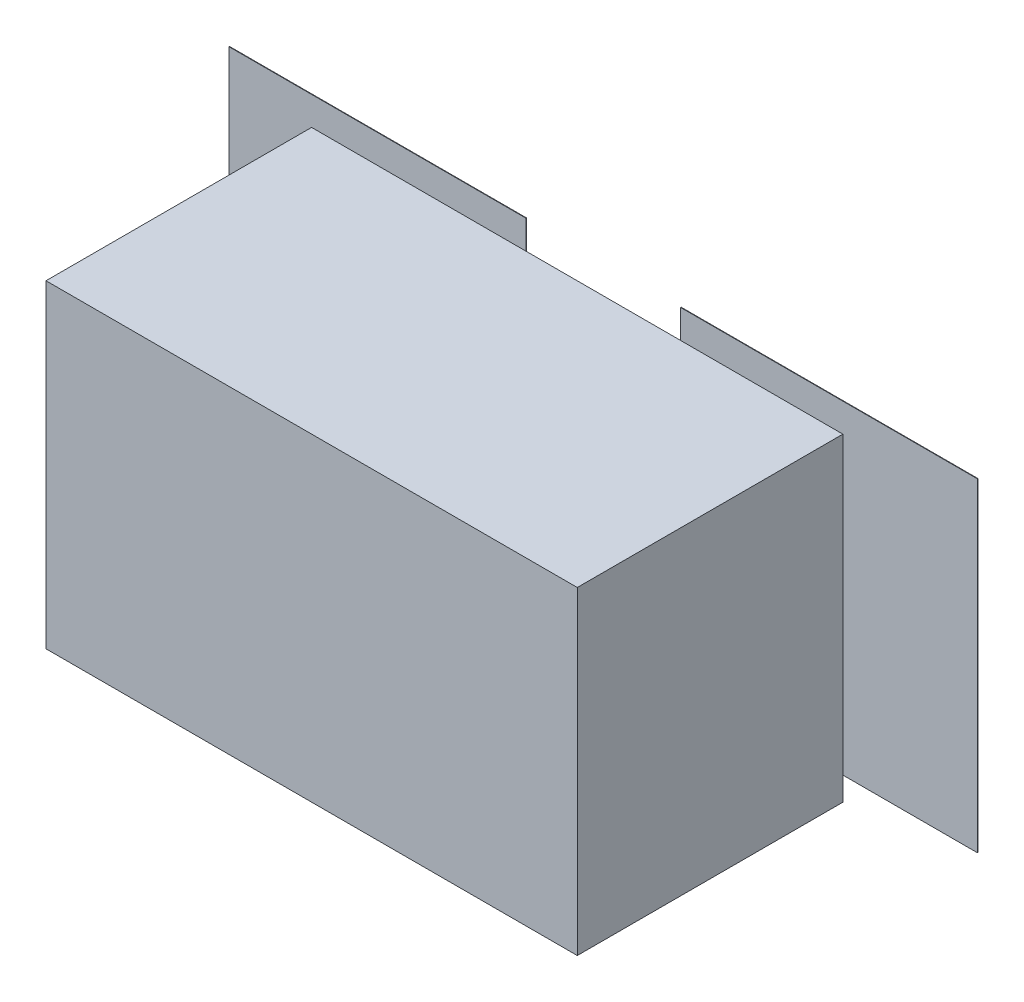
ISO-10303-21;
HEADER;
FILE_DESCRIPTION(('STEP AP214'),'2;1');
FILE_NAME('part.step','',(''),(''),'','','');
FILE_SCHEMA(('AUTOMOTIVE_DESIGN { 1 0 10303 214 1 1 1 1 }'));
ENDSEC;
DATA;
#1=APPLICATION_CONTEXT('core data for automotive mechanical design processes');
#2=APPLICATION_PROTOCOL_DEFINITION('international standard','automotive_design',2000,#1);
#3=PRODUCT_CONTEXT('',#1,'mechanical');
#4=PRODUCT('Part','Part','',(#3));
#5=PRODUCT_RELATED_PRODUCT_CATEGORY('part','',(#4));
#6=PRODUCT_DEFINITION_FORMATION('','',#4);
#7=PRODUCT_DEFINITION_CONTEXT('part definition',#1,'design');
#8=PRODUCT_DEFINITION('design','',#6,#7);
#9=PRODUCT_DEFINITION_SHAPE('','',#8);
#10=(LENGTH_UNIT() NAMED_UNIT(*) SI_UNIT(.MILLI.,.METRE.));
#11=(NAMED_UNIT(*) PLANE_ANGLE_UNIT() SI_UNIT($,.RADIAN.));
#12=(NAMED_UNIT(*) SI_UNIT($,.STERADIAN.) SOLID_ANGLE_UNIT());
#13=UNCERTAINTY_MEASURE_WITH_UNIT(LENGTH_MEASURE(1.E-05),#10,'distance_accuracy_value','');
#14=(GEOMETRIC_REPRESENTATION_CONTEXT(3) GLOBAL_UNCERTAINTY_ASSIGNED_CONTEXT((#13)) GLOBAL_UNIT_ASSIGNED_CONTEXT((#10,
#11,#12)) REPRESENTATION_CONTEXT('',''));
#15=CARTESIAN_POINT('',(0.,0.,0.));
#16=DIRECTION('',(0.,0.,1.));
#17=DIRECTION('',(1.,0.,0.));
#18=AXIS2_PLACEMENT_3D('',#15,#16,#17);
#19=CARTESIAN_POINT('',(0.,0.,0.0762));
#20=DIRECTION('',(0.,0.,1.));
#21=DIRECTION('',(1.,0.,0.));
#22=AXIS2_PLACEMENT_3D('',#19,#20,#21);
#23=PLANE('',#22);
#24=DIRECTION('',(1.,0.,0.));
#25=VECTOR('',#24,1.);
#26=CARTESIAN_POINT('',(-0.704342,-0.3048,0.0762));
#27=LINE('',#26,#25);
#28=CARTESIAN_POINT('',(-0.704342,-0.3048,0.0762));
#29=VERTEX_POINT('',#28);
#30=CARTESIAN_POINT('',(-0.145542,-0.3048,0.0762));
#31=VERTEX_POINT('',#30);
#32=EDGE_CURVE('E166',#29,#31,#27,.T.);
#33=ORIENTED_EDGE('',*,*,#32,.F.);
#34=DIRECTION('',(0.,1.,0.));
#35=VECTOR('',#34,1.);
#36=CARTESIAN_POINT('',(-0.704342,0.3048,0.0762));
#37=LINE('',#36,#35);
#38=CARTESIAN_POINT('',(-0.704342,0.3048,0.0762));
#39=VERTEX_POINT('',#38);
#40=EDGE_CURVE('E163',#39,#29,#37,.F.);
#41=ORIENTED_EDGE('',*,*,#40,.F.);
#42=DIRECTION('',(1.,0.,0.));
#43=VECTOR('',#42,1.);
#44=CARTESIAN_POINT('',(-0.145542,0.3048,0.0762));
#45=LINE('',#44,#43);
#46=CARTESIAN_POINT('',(-0.145542,0.3048,0.0762));
#47=VERTEX_POINT('',#46);
#48=EDGE_CURVE('E219',#47,#39,#45,.F.);
#49=ORIENTED_EDGE('',*,*,#48,.F.);
#50=DIRECTION('',(0.,1.,0.));
#51=VECTOR('',#50,1.);
#52=CARTESIAN_POINT('',(-0.145542,-0.3048,0.0762));
#53=LINE('',#52,#51);
#54=EDGE_CURVE('E189',#31,#47,#53,.T.);
#55=ORIENTED_EDGE('',*,*,#54,.F.);
#56=EDGE_LOOP('',(#33,#41,#49,#55));
#57=FACE_BOUND('',#56,.T.);
#58=ADVANCED_FACE('F17',(#57),#23,.F.);
#59=CARTESIAN_POINT('',(0.,0.,0.0762));
#60=DIRECTION('',(0.,0.,1.));
#61=DIRECTION('',(1.,0.,0.));
#62=AXIS2_PLACEMENT_3D('',#59,#60,#61);
#63=PLANE('',#62);
#64=DIRECTION('',(1.,0.,0.));
#65=VECTOR('',#64,1.);
#66=CARTESIAN_POINT('',(0.145542,-0.3048,0.0762));
#67=LINE('',#66,#65);
#68=CARTESIAN_POINT('',(0.145542,-0.3048,0.0762));
#69=VERTEX_POINT('',#68);
#70=CARTESIAN_POINT('',(0.704342,-0.3048,0.0762));
#71=VERTEX_POINT('',#70);
#72=EDGE_CURVE('E211',#69,#71,#67,.T.);
#73=ORIENTED_EDGE('',*,*,#72,.F.);
#74=DIRECTION('',(0.,1.,0.));
#75=VECTOR('',#74,1.);
#76=CARTESIAN_POINT('',(0.145542,0.3048,0.0762));
#77=LINE('',#76,#75);
#78=CARTESIAN_POINT('',(0.145542,0.3048,0.0762));
#79=VERTEX_POINT('',#78);
#80=EDGE_CURVE('E215',#79,#69,#77,.F.);
#81=ORIENTED_EDGE('',*,*,#80,.F.);
#82=DIRECTION('',(1.,0.,0.));
#83=VECTOR('',#82,1.);
#84=CARTESIAN_POINT('',(0.704342,0.3048,0.0762));
#85=LINE('',#84,#83);
#86=CARTESIAN_POINT('',(0.704342,0.3048,0.0762));
#87=VERTEX_POINT('',#86);
#88=EDGE_CURVE('E181',#87,#79,#85,.F.);
#89=ORIENTED_EDGE('',*,*,#88,.F.);
#90=DIRECTION('',(0.,1.,0.));
#91=VECTOR('',#90,1.);
#92=CARTESIAN_POINT('',(0.704342,-0.3048,0.0762));
#93=LINE('',#92,#91);
#94=EDGE_CURVE('E207',#71,#87,#93,.T.);
#95=ORIENTED_EDGE('',*,*,#94,.F.);
#96=EDGE_LOOP('',(#73,#81,#89,#95));
#97=FACE_BOUND('',#96,.T.);
#98=ADVANCED_FACE('F588',(#97),#63,.F.);
#99=CARTESIAN_POINT('',(-0.704342,0.3048,0.0762));
#100=DIRECTION('',(-1.,0.,0.));
#101=DIRECTION('',(0.,0.,1.));
#102=AXIS2_PLACEMENT_3D('',#99,#100,#101);
#103=PLANE('',#102);
#104=DIRECTION('',(0.,0.,1.));
#105=VECTOR('',#104,1.);
#106=CARTESIAN_POINT('',(-0.704342,0.3048,0.0762));
#107=LINE('',#106,#105);
#108=CARTESIAN_POINT('',(-0.704342,0.3048,0.077199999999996));
#109=VERTEX_POINT('',#108);
#110=EDGE_CURVE('E190',#39,#109,#107,.T.);
#111=ORIENTED_EDGE('',*,*,#110,.F.);
#112=ORIENTED_EDGE('',*,*,#40,.T.);
#113=DIRECTION('',(0.,0.,-1.));
#114=VECTOR('',#113,1.);
#115=CARTESIAN_POINT('',(-0.704342,-0.3048,0.0762));
#116=LINE('',#115,#114);
#117=CARTESIAN_POINT('',(-0.704342,-0.3048,0.077199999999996));
#118=VERTEX_POINT('',#117);
#119=EDGE_CURVE('E20',#118,#29,#116,.T.);
#120=ORIENTED_EDGE('',*,*,#119,.F.);
#121=DIRECTION('',(0.,1.,0.));
#122=VECTOR('',#121,1.);
#123=CARTESIAN_POINT('',(-0.704342,0.,0.077199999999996));
#124=LINE('',#123,#122);
#125=EDGE_CURVE('E161',#109,#118,#124,.F.);
#126=ORIENTED_EDGE('',*,*,#125,.F.);
#127=EDGE_LOOP('',(#111,#112,#120,#126));
#128=FACE_BOUND('',#127,.T.);
#129=ADVANCED_FACE('F159',(#128),#103,.T.);
#130=CARTESIAN_POINT('',(-0.704342,-0.3048,0.0762));
#131=DIRECTION('',(0.,-1.,0.));
#132=DIRECTION('',(0.,0.,-1.));
#133=AXIS2_PLACEMENT_3D('',#130,#131,#132);
#134=PLANE('',#133);
#135=ORIENTED_EDGE('',*,*,#119,.T.);
#136=ORIENTED_EDGE('',*,*,#32,.T.);
#137=DIRECTION('',(0.,0.,-1.));
#138=VECTOR('',#137,1.);
#139=CARTESIAN_POINT('',(-0.145542,-0.3048,0.0762));
#140=LINE('',#139,#138);
#141=CARTESIAN_POINT('',(-0.145542,-0.3048,0.077199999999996));
#142=VERTEX_POINT('',#141);
#143=EDGE_CURVE('E171',#142,#31,#140,.T.);
#144=ORIENTED_EDGE('',*,*,#143,.F.);
#145=DIRECTION('',(1.,0.,0.));
#146=VECTOR('',#145,1.);
#147=CARTESIAN_POINT('',(0.,-0.3048,0.077199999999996));
#148=LINE('',#147,#146);
#149=EDGE_CURVE('E168',#118,#142,#148,.T.);
#150=ORIENTED_EDGE('',*,*,#149,.F.);
#151=EDGE_LOOP('',(#135,#136,#144,#150));
#152=FACE_BOUND('',#151,.T.);
#153=ADVANCED_FACE('F169',(#152),#134,.T.);
#154=CARTESIAN_POINT('',(-0.145542,-0.3048,0.0762));
#155=DIRECTION('',(1.,0.,0.));
#156=DIRECTION('',(0.,0.,-1.));
#157=AXIS2_PLACEMENT_3D('',#154,#155,#156);
#158=PLANE('',#157);
#159=ORIENTED_EDGE('',*,*,#143,.T.);
#160=ORIENTED_EDGE('',*,*,#54,.T.);
#161=DIRECTION('',(0.,0.,1.));
#162=VECTOR('',#161,1.);
#163=CARTESIAN_POINT('',(-0.145542,0.3048,0.0762));
#164=LINE('',#163,#162);
#165=CARTESIAN_POINT('',(-0.145542,0.3048,0.077199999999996));
#166=VERTEX_POINT('',#165);
#167=EDGE_CURVE('E216',#166,#47,#164,.F.);
#168=ORIENTED_EDGE('',*,*,#167,.F.);
#169=DIRECTION('',(0.,1.,0.));
#170=VECTOR('',#169,1.);
#171=CARTESIAN_POINT('',(-0.145542,0.,0.077199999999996));
#172=LINE('',#171,#170);
#173=EDGE_CURVE('E175',#142,#166,#172,.T.);
#174=ORIENTED_EDGE('',*,*,#173,.F.);
#175=EDGE_LOOP('',(#159,#160,#168,#174));
#176=FACE_BOUND('',#175,.T.);
#177=ADVANCED_FACE('F221',(#176),#158,.T.);
#178=CARTESIAN_POINT('',(-0.145542,0.3048,0.0762));
#179=DIRECTION('',(0.,1.,0.));
#180=DIRECTION('',(0.,0.,1.));
#181=AXIS2_PLACEMENT_3D('',#178,#179,#180);
#182=PLANE('',#181);
#183=ORIENTED_EDGE('',*,*,#167,.T.);
#184=ORIENTED_EDGE('',*,*,#48,.T.);
#185=ORIENTED_EDGE('',*,*,#110,.T.);
#186=DIRECTION('',(1.,0.,0.));
#187=VECTOR('',#186,1.);
#188=CARTESIAN_POINT('',(0.,0.3048,0.077199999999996));
#189=LINE('',#188,#187);
#190=EDGE_CURVE('E180',#166,#109,#189,.F.);
#191=ORIENTED_EDGE('',*,*,#190,.F.);
#192=EDGE_LOOP('',(#183,#184,#185,#191));
#193=FACE_BOUND('',#192,.T.);
#194=ADVANCED_FACE('F557',(#193),#182,.T.);
#195=CARTESIAN_POINT('',(0.145542,0.3048,0.0762));
#196=DIRECTION('',(-1.,0.,0.));
#197=DIRECTION('',(0.,0.,1.));
#198=AXIS2_PLACEMENT_3D('',#195,#196,#197);
#199=PLANE('',#198);
#200=DIRECTION('',(0.,0.,1.));
#201=VECTOR('',#200,1.);
#202=CARTESIAN_POINT('',(0.145542,0.3048,0.0762));
#203=LINE('',#202,#201);
#204=CARTESIAN_POINT('',(0.145542,0.3048,0.077199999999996));
#205=VERTEX_POINT('',#204);
#206=EDGE_CURVE('E204',#79,#205,#203,.T.);
#207=ORIENTED_EDGE('',*,*,#206,.F.);
#208=ORIENTED_EDGE('',*,*,#80,.T.);
#209=DIRECTION('',(0.,0.,-1.));
#210=VECTOR('',#209,1.);
#211=CARTESIAN_POINT('',(0.145542,-0.3048,0.0762));
#212=LINE('',#211,#210);
#213=CARTESIAN_POINT('',(0.145542,-0.3048,0.077199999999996));
#214=VERTEX_POINT('',#213);
#215=EDGE_CURVE('E212',#214,#69,#212,.T.);
#216=ORIENTED_EDGE('',*,*,#215,.F.);
#217=DIRECTION('',(0.,1.,0.));
#218=VECTOR('',#217,1.);
#219=CARTESIAN_POINT('',(0.145542,0.,0.077199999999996));
#220=LINE('',#219,#218);
#221=EDGE_CURVE('E224',#205,#214,#220,.F.);
#222=ORIENTED_EDGE('',*,*,#221,.F.);
#223=EDGE_LOOP('',(#207,#208,#216,#222));
#224=FACE_BOUND('',#223,.T.);
#225=ADVANCED_FACE('F548',(#224),#199,.T.);
#226=CARTESIAN_POINT('',(0.145542,-0.3048,0.0762));
#227=DIRECTION('',(0.,-1.,0.));
#228=DIRECTION('',(0.,0.,-1.));
#229=AXIS2_PLACEMENT_3D('',#226,#227,#228);
#230=PLANE('',#229);
#231=ORIENTED_EDGE('',*,*,#215,.T.);
#232=ORIENTED_EDGE('',*,*,#72,.T.);
#233=DIRECTION('',(0.,0.,-1.));
#234=VECTOR('',#233,1.);
#235=CARTESIAN_POINT('',(0.704342,-0.3048,0.0762));
#236=LINE('',#235,#234);
#237=CARTESIAN_POINT('',(0.704342,-0.3048,0.077199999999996));
#238=VERTEX_POINT('',#237);
#239=EDGE_CURVE('E208',#238,#71,#236,.T.);
#240=ORIENTED_EDGE('',*,*,#239,.F.);
#241=DIRECTION('',(1.,0.,0.));
#242=VECTOR('',#241,1.);
#243=CARTESIAN_POINT('',(0.,-0.3048,0.077199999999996));
#244=LINE('',#243,#242);
#245=EDGE_CURVE('E230',#214,#238,#244,.T.);
#246=ORIENTED_EDGE('',*,*,#245,.F.);
#247=EDGE_LOOP('',(#231,#232,#240,#246));
#248=FACE_BOUND('',#247,.T.);
#249=ADVANCED_FACE('F539',(#248),#230,.T.);
#250=CARTESIAN_POINT('',(0.704342,-0.3048,0.0762));
#251=DIRECTION('',(1.,0.,0.));
#252=DIRECTION('',(0.,0.,-1.));
#253=AXIS2_PLACEMENT_3D('',#250,#251,#252);
#254=PLANE('',#253);
#255=ORIENTED_EDGE('',*,*,#239,.T.);
#256=ORIENTED_EDGE('',*,*,#94,.T.);
#257=DIRECTION('',(0.,0.,1.));
#258=VECTOR('',#257,1.);
#259=CARTESIAN_POINT('',(0.704342,0.3048,0.0762));
#260=LINE('',#259,#258);
#261=CARTESIAN_POINT('',(0.704342,0.3048,0.077199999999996));
#262=VERTEX_POINT('',#261);
#263=EDGE_CURVE('E184',#262,#87,#260,.F.);
#264=ORIENTED_EDGE('',*,*,#263,.F.);
#265=DIRECTION('',(0.,1.,0.));
#266=VECTOR('',#265,1.);
#267=CARTESIAN_POINT('',(0.704342,0.,0.077199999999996));
#268=LINE('',#267,#266);
#269=EDGE_CURVE('E233',#238,#262,#268,.T.);
#270=ORIENTED_EDGE('',*,*,#269,.F.);
#271=EDGE_LOOP('',(#255,#256,#264,#270));
#272=FACE_BOUND('',#271,.T.);
#273=ADVANCED_FACE('F530',(#272),#254,.T.);
#274=CARTESIAN_POINT('',(0.704342,0.3048,0.0762));
#275=DIRECTION('',(0.,1.,0.));
#276=DIRECTION('',(0.,0.,1.));
#277=AXIS2_PLACEMENT_3D('',#274,#275,#276);
#278=PLANE('',#277);
#279=ORIENTED_EDGE('',*,*,#263,.T.);
#280=ORIENTED_EDGE('',*,*,#88,.T.);
#281=ORIENTED_EDGE('',*,*,#206,.T.);
#282=DIRECTION('',(1.,0.,0.));
#283=VECTOR('',#282,1.);
#284=CARTESIAN_POINT('',(0.,0.3048,0.077199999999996));
#285=LINE('',#284,#283);
#286=EDGE_CURVE('E237',#262,#205,#285,.F.);
#287=ORIENTED_EDGE('',*,*,#286,.F.);
#288=EDGE_LOOP('',(#279,#280,#281,#287));
#289=FACE_BOUND('',#288,.T.);
#290=ADVANCED_FACE('F521',(#289),#278,.T.);
#291=CARTESIAN_POINT('',(0.,0.,0.077199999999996));
#292=DIRECTION('',(0.,0.,1.));
#293=DIRECTION('',(1.,0.,0.));
#294=AXIS2_PLACEMENT_3D('',#291,#292,#293);
#295=PLANE('',#294);
#296=DIRECTION('',(1.,0.,0.));
#297=VECTOR('',#296,1.);
#298=CARTESIAN_POINT('',(-0.449999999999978,-0.249999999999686,0.077199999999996));
#299=LINE('',#298,#297);
#300=CARTESIAN_POINT('',(-0.449999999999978,-0.249999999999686,0.077199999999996));
#301=VERTEX_POINT('',#300);
#302=CARTESIAN_POINT('',(-0.199999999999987,-0.249999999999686,0.077199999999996));
#303=VERTEX_POINT('',#302);
#304=EDGE_CURVE('E266',#301,#303,#299,.T.);
#305=ORIENTED_EDGE('',*,*,#304,.F.);
#306=DIRECTION('',(0.,1.,0.));
#307=VECTOR('',#306,1.);
#308=CARTESIAN_POINT('',(-0.449999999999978,0.250000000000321,0.077199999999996));
#309=LINE('',#308,#307);
#310=CARTESIAN_POINT('',(-0.449999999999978,0.250000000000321,0.077199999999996));
#311=VERTEX_POINT('',#310);
#312=EDGE_CURVE('E240',#311,#301,#309,.F.);
#313=ORIENTED_EDGE('',*,*,#312,.F.);
#314=DIRECTION('',(1.,0.,0.));
#315=VECTOR('',#314,1.);
#316=CARTESIAN_POINT('',(-0.199999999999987,0.250000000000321,0.077199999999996));
#317=LINE('',#316,#315);
#318=CARTESIAN_POINT('',(-0.199999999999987,0.250000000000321,0.077199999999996));
#319=VERTEX_POINT('',#318);
#320=EDGE_CURVE('E271',#319,#311,#317,.F.);
#321=ORIENTED_EDGE('',*,*,#320,.F.);
#322=DIRECTION('',(0.,1.,0.));
#323=VECTOR('',#322,1.);
#324=CARTESIAN_POINT('',(-0.199999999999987,-0.249999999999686,0.077199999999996));
#325=LINE('',#324,#323);
#326=EDGE_CURVE('E277',#303,#319,#325,.T.);
#327=ORIENTED_EDGE('',*,*,#326,.F.);
#328=EDGE_LOOP('',(#305,#313,#321,#327));
#329=FACE_BOUND('',#328,.T.);
#330=ORIENTED_EDGE('',*,*,#173,.T.);
#331=ORIENTED_EDGE('',*,*,#190,.T.);
#332=ORIENTED_EDGE('',*,*,#125,.T.);
#333=ORIENTED_EDGE('',*,*,#149,.T.);
#334=EDGE_LOOP('',(#330,#331,#332,#333));
#335=FACE_BOUND('',#334,.T.);
#336=ADVANCED_FACE('F178',(#329,#335),#295,.T.);
#337=CARTESIAN_POINT('',(0.,0.,0.077199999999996));
#338=DIRECTION('',(0.,0.,1.));
#339=DIRECTION('',(1.,0.,0.));
#340=AXIS2_PLACEMENT_3D('',#337,#338,#339);
#341=PLANE('',#340);
#342=DIRECTION('',(0.,1.,0.));
#343=VECTOR('',#342,1.);
#344=CARTESIAN_POINT('',(0.199999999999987,0.250000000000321,0.077199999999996));
#345=LINE('',#344,#343);
#346=CARTESIAN_POINT('',(0.199999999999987,0.250000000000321,0.077199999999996));
#347=VERTEX_POINT('',#346);
#348=CARTESIAN_POINT('',(0.199999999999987,-0.249999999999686,0.077199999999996));
#349=VERTEX_POINT('',#348);
#350=EDGE_CURVE('E257',#347,#349,#345,.F.);
#351=ORIENTED_EDGE('',*,*,#350,.F.);
#352=DIRECTION('',(1.,0.,0.));
#353=VECTOR('',#352,1.);
#354=CARTESIAN_POINT('',(0.449999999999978,0.250000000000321,0.077199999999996));
#355=LINE('',#354,#353);
#356=CARTESIAN_POINT('',(0.449999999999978,0.250000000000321,0.077199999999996));
#357=VERTEX_POINT('',#356);
#358=EDGE_CURVE('E264',#357,#347,#355,.F.);
#359=ORIENTED_EDGE('',*,*,#358,.F.);
#360=DIRECTION('',(0.,1.,0.));
#361=VECTOR('',#360,1.);
#362=CARTESIAN_POINT('',(0.449999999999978,-0.149999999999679,0.077199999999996));
#363=LINE('',#362,#361);
#364=CARTESIAN_POINT('',(0.449999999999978,-0.149999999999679,0.077199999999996));
#365=VERTEX_POINT('',#364);
#366=EDGE_CURVE('E201',#365,#357,#363,.T.);
#367=ORIENTED_EDGE('',*,*,#366,.F.);
#368=CARTESIAN_POINT('',(0.449999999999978,-0.249999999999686,0.077199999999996));
#369=DIRECTION('',(0.,0.,1.));
#370=DIRECTION('',(1.,0.,0.));
#371=AXIS2_PLACEMENT_3D('',#368,#369,#370);
#372=CIRCLE('',#371,0.100000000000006);
#373=CARTESIAN_POINT('',(0.350000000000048,-0.249999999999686,0.077199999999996));
#374=VERTEX_POINT('',#373);
#375=EDGE_CURVE('E198',#365,#374,#372,.T.);
#376=ORIENTED_EDGE('',*,*,#375,.T.);
#377=DIRECTION('',(1.,0.,0.));
#378=VECTOR('',#377,1.);
#379=CARTESIAN_POINT('',(0.199999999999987,-0.249999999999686,0.077199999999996));
#380=LINE('',#379,#378);
#381=EDGE_CURVE('E250',#349,#374,#380,.T.);
#382=ORIENTED_EDGE('',*,*,#381,.F.);
#383=EDGE_LOOP('',(#351,#359,#367,#376,#382));
#384=FACE_BOUND('',#383,.T.);
#385=ORIENTED_EDGE('',*,*,#269,.T.);
#386=ORIENTED_EDGE('',*,*,#286,.T.);
#387=ORIENTED_EDGE('',*,*,#221,.T.);
#388=ORIENTED_EDGE('',*,*,#245,.T.);
#389=EDGE_LOOP('',(#385,#386,#387,#388));
#390=FACE_BOUND('',#389,.T.);
#391=ADVANCED_FACE('F504',(#384,#390),#341,.T.);
#392=CARTESIAN_POINT('',(-0.449999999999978,0.250000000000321,0.0762));
#393=DIRECTION('',(-1.,0.,0.));
#394=DIRECTION('',(0.,0.,1.));
#395=AXIS2_PLACEMENT_3D('',#392,#393,#394);
#396=PLANE('',#395);
#397=DIRECTION('',(0.,0.,1.));
#398=VECTOR('',#397,1.);
#399=CARTESIAN_POINT('',(-0.449999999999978,0.250000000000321,0.0762));
#400=LINE('',#399,#398);
#401=CARTESIAN_POINT('',(-0.449999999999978,0.250000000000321,0.126200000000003));
#402=VERTEX_POINT('',#401);
#403=EDGE_CURVE('E268',#311,#402,#400,.T.);
#404=ORIENTED_EDGE('',*,*,#403,.F.);
#405=ORIENTED_EDGE('',*,*,#312,.T.);
#406=DIRECTION('',(0.,0.,-1.));
#407=VECTOR('',#406,1.);
#408=CARTESIAN_POINT('',(-0.449999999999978,-0.249999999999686,0.0762));
#409=LINE('',#408,#407);
#410=CARTESIAN_POINT('',(-0.449999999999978,-0.249999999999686,0.126200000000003));
#411=VERTEX_POINT('',#410);
#412=EDGE_CURVE('E283',#411,#301,#409,.T.);
#413=ORIENTED_EDGE('',*,*,#412,.F.);
#414=DIRECTION('',(0.,1.,0.));
#415=VECTOR('',#414,1.);
#416=CARTESIAN_POINT('',(-0.449999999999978,0.,0.126200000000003));
#417=LINE('',#416,#415);
#418=EDGE_CURVE('E260',#411,#402,#417,.T.);
#419=ORIENTED_EDGE('',*,*,#418,.T.);
#420=EDGE_LOOP('',(#404,#405,#413,#419));
#421=FACE_BOUND('',#420,.T.);
#422=ADVANCED_FACE('F495',(#421),#396,.T.);
#423=CARTESIAN_POINT('',(-0.199999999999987,0.250000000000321,0.0762));
#424=DIRECTION('',(0.,1.,0.));
#425=DIRECTION('',(0.,0.,1.));
#426=AXIS2_PLACEMENT_3D('',#423,#424,#425);
#427=PLANE('',#426);
#428=DIRECTION('',(0.,0.,-1.));
#429=VECTOR('',#428,1.);
#430=CARTESIAN_POINT('',(-0.199999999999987,0.250000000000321,0.0762));
#431=LINE('',#430,#429);
#432=CARTESIAN_POINT('',(-0.199999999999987,0.250000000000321,0.126200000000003));
#433=VERTEX_POINT('',#432);
#434=EDGE_CURVE('E274',#319,#433,#431,.F.);
#435=ORIENTED_EDGE('',*,*,#434,.F.);
#436=ORIENTED_EDGE('',*,*,#320,.T.);
#437=ORIENTED_EDGE('',*,*,#403,.T.);
#438=DIRECTION('',(1.,0.,0.));
#439=VECTOR('',#438,1.);
#440=CARTESIAN_POINT('',(0.,0.250000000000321,0.126200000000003));
#441=LINE('',#440,#439);
#442=EDGE_CURVE('E316',#402,#433,#441,.T.);
#443=ORIENTED_EDGE('',*,*,#442,.T.);
#444=EDGE_LOOP('',(#435,#436,#437,#443));
#445=FACE_BOUND('',#444,.T.);
#446=ADVANCED_FACE('F486',(#445),#427,.T.);
#447=CARTESIAN_POINT('',(-0.199999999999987,-0.249999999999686,0.0762));
#448=DIRECTION('',(1.,0.,0.));
#449=DIRECTION('',(0.,0.,-1.));
#450=AXIS2_PLACEMENT_3D('',#447,#448,#449);
#451=PLANE('',#450);
#452=DIRECTION('',(0.,0.,-1.));
#453=VECTOR('',#452,1.);
#454=CARTESIAN_POINT('',(-0.199999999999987,-0.249999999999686,0.0762));
#455=LINE('',#454,#453);
#456=CARTESIAN_POINT('',(-0.199999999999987,-0.249999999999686,0.126200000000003));
#457=VERTEX_POINT('',#456);
#458=EDGE_CURVE('E280',#303,#457,#455,.F.);
#459=ORIENTED_EDGE('',*,*,#458,.F.);
#460=ORIENTED_EDGE('',*,*,#326,.T.);
#461=ORIENTED_EDGE('',*,*,#434,.T.);
#462=DIRECTION('',(0.,1.,0.));
#463=VECTOR('',#462,1.);
#464=CARTESIAN_POINT('',(-0.199999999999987,0.,0.126200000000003));
#465=LINE('',#464,#463);
#466=EDGE_CURVE('E318',#433,#457,#465,.F.);
#467=ORIENTED_EDGE('',*,*,#466,.T.);
#468=EDGE_LOOP('',(#459,#460,#461,#467));
#469=FACE_BOUND('',#468,.T.);
#470=ADVANCED_FACE('F477',(#469),#451,.T.);
#471=CARTESIAN_POINT('',(-0.449999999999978,-0.249999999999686,0.0762));
#472=DIRECTION('',(0.,-1.,0.));
#473=DIRECTION('',(0.,0.,-1.));
#474=AXIS2_PLACEMENT_3D('',#471,#472,#473);
#475=PLANE('',#474);
#476=ORIENTED_EDGE('',*,*,#412,.T.);
#477=ORIENTED_EDGE('',*,*,#304,.T.);
#478=ORIENTED_EDGE('',*,*,#458,.T.);
#479=DIRECTION('',(1.,0.,0.));
#480=VECTOR('',#479,1.);
#481=CARTESIAN_POINT('',(0.,-0.249999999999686,0.126200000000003));
#482=LINE('',#481,#480);
#483=EDGE_CURVE('E296',#457,#411,#482,.F.);
#484=ORIENTED_EDGE('',*,*,#483,.T.);
#485=EDGE_LOOP('',(#476,#477,#478,#484));
#486=FACE_BOUND('',#485,.T.);
#487=ADVANCED_FACE('F468',(#486),#475,.T.);
#488=CARTESIAN_POINT('',(0.449999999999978,0.250000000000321,0.0762));
#489=DIRECTION('',(0.,1.,0.));
#490=DIRECTION('',(0.,0.,1.));
#491=AXIS2_PLACEMENT_3D('',#488,#489,#490);
#492=PLANE('',#491);
#493=DIRECTION('',(0.,0.,-1.));
#494=VECTOR('',#493,1.);
#495=CARTESIAN_POINT('',(0.449999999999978,0.250000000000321,0.0762));
#496=LINE('',#495,#494);
#497=CARTESIAN_POINT('',(0.449999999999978,0.250000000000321,0.126200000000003));
#498=VERTEX_POINT('',#497);
#499=EDGE_CURVE('E247',#357,#498,#496,.F.);
#500=ORIENTED_EDGE('',*,*,#499,.F.);
#501=ORIENTED_EDGE('',*,*,#358,.T.);
#502=DIRECTION('',(0.,0.,1.));
#503=VECTOR('',#502,1.);
#504=CARTESIAN_POINT('',(0.199999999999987,0.250000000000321,0.0762));
#505=LINE('',#504,#503);
#506=CARTESIAN_POINT('',(0.199999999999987,0.250000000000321,0.126200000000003));
#507=VERTEX_POINT('',#506);
#508=EDGE_CURVE('E261',#507,#347,#505,.F.);
#509=ORIENTED_EDGE('',*,*,#508,.F.);
#510=DIRECTION('',(1.,0.,0.));
#511=VECTOR('',#510,1.);
#512=CARTESIAN_POINT('',(0.,0.250000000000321,0.126200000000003));
#513=LINE('',#512,#511);
#514=EDGE_CURVE('E294',#507,#498,#513,.T.);
#515=ORIENTED_EDGE('',*,*,#514,.T.);
#516=EDGE_LOOP('',(#500,#501,#509,#515));
#517=FACE_BOUND('',#516,.T.);
#518=ADVANCED_FACE('F459',(#517),#492,.T.);
#519=CARTESIAN_POINT('',(0.449999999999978,-0.149999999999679,0.0762));
#520=DIRECTION('',(1.,0.,0.));
#521=DIRECTION('',(0.,0.,-1.));
#522=AXIS2_PLACEMENT_3D('',#519,#520,#521);
#523=PLANE('',#522);
#524=DIRECTION('',(0.,0.,1.));
#525=VECTOR('',#524,1.);
#526=CARTESIAN_POINT('',(0.449999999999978,-0.149999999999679,0.0762));
#527=LINE('',#526,#525);
#528=CARTESIAN_POINT('',(0.449999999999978,-0.149999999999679,0.126200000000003));
#529=VERTEX_POINT('',#528);
#530=EDGE_CURVE('E200',#529,#365,#527,.F.);
#531=ORIENTED_EDGE('',*,*,#530,.T.);
#532=ORIENTED_EDGE('',*,*,#366,.T.);
#533=ORIENTED_EDGE('',*,*,#499,.T.);
#534=DIRECTION('',(0.,1.,0.));
#535=VECTOR('',#534,1.);
#536=CARTESIAN_POINT('',(0.449999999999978,0.,0.126200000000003));
#537=LINE('',#536,#535);
#538=EDGE_CURVE('E197',#498,#529,#537,.F.);
#539=ORIENTED_EDGE('',*,*,#538,.T.);
#540=EDGE_LOOP('',(#531,#532,#533,#539));
#541=FACE_BOUND('',#540,.T.);
#542=ADVANCED_FACE('F450',(#541),#523,.T.);
#543=CARTESIAN_POINT('',(0.449999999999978,-0.249999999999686,0.0762));
#544=DIRECTION('',(0.,0.,1.));
#545=DIRECTION('',(1.,0.,0.));
#546=AXIS2_PLACEMENT_3D('',#543,#544,#545);
#547=CYLINDRICAL_SURFACE('',#546,0.100000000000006);
#548=CARTESIAN_POINT('',(0.449999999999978,-0.249999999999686,0.126200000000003));
#549=DIRECTION('',(0.,0.,1.));
#550=DIRECTION('',(1.,0.,0.));
#551=AXIS2_PLACEMENT_3D('',#548,#549,#550);
#552=CIRCLE('',#551,0.100000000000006);
#553=CARTESIAN_POINT('',(0.350000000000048,-0.249999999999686,0.126200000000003));
#554=VERTEX_POINT('',#553);
#555=EDGE_CURVE('E194',#529,#554,#552,.T.);
#556=ORIENTED_EDGE('',*,*,#555,.T.);
#557=DIRECTION('',(0.,0.,-1.));
#558=VECTOR('',#557,1.);
#559=CARTESIAN_POINT('',(0.350000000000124,-0.249999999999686,0.0762));
#560=LINE('',#559,#558);
#561=EDGE_CURVE('E254',#374,#554,#560,.F.);
#562=ORIENTED_EDGE('',*,*,#561,.F.);
#563=ORIENTED_EDGE('',*,*,#375,.F.);
#564=ORIENTED_EDGE('',*,*,#530,.F.);
#565=EDGE_LOOP('',(#556,#562,#563,#564));
#566=FACE_BOUND('',#565,.T.);
#567=ADVANCED_FACE('F441',(#566),#547,.F.);
#568=CARTESIAN_POINT('',(0.199999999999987,-0.249999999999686,0.0762));
#569=DIRECTION('',(0.,-1.,0.));
#570=DIRECTION('',(0.,0.,-1.));
#571=AXIS2_PLACEMENT_3D('',#568,#569,#570);
#572=PLANE('',#571);
#573=DIRECTION('',(0.,0.,1.));
#574=VECTOR('',#573,1.);
#575=CARTESIAN_POINT('',(0.199999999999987,-0.249999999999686,0.0762));
#576=LINE('',#575,#574);
#577=CARTESIAN_POINT('',(0.199999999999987,-0.249999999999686,0.126200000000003));
#578=VERTEX_POINT('',#577);
#579=EDGE_CURVE('E253',#349,#578,#576,.T.);
#580=ORIENTED_EDGE('',*,*,#579,.F.);
#581=ORIENTED_EDGE('',*,*,#381,.T.);
#582=ORIENTED_EDGE('',*,*,#561,.T.);
#583=DIRECTION('',(1.,0.,0.));
#584=VECTOR('',#583,1.);
#585=CARTESIAN_POINT('',(0.,-0.249999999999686,0.126200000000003));
#586=LINE('',#585,#584);
#587=EDGE_CURVE('E196',#554,#578,#586,.F.);
#588=ORIENTED_EDGE('',*,*,#587,.T.);
#589=EDGE_LOOP('',(#580,#581,#582,#588));
#590=FACE_BOUND('',#589,.T.);
#591=ADVANCED_FACE('F432',(#590),#572,.T.);
#592=CARTESIAN_POINT('',(0.199999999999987,0.250000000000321,0.0762));
#593=DIRECTION('',(-1.,0.,0.));
#594=DIRECTION('',(0.,0.,1.));
#595=AXIS2_PLACEMENT_3D('',#592,#593,#594);
#596=PLANE('',#595);
#597=ORIENTED_EDGE('',*,*,#508,.T.);
#598=ORIENTED_EDGE('',*,*,#350,.T.);
#599=ORIENTED_EDGE('',*,*,#579,.T.);
#600=DIRECTION('',(0.,1.,0.));
#601=VECTOR('',#600,1.);
#602=CARTESIAN_POINT('',(0.199999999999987,0.,0.126200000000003));
#603=LINE('',#602,#601);
#604=EDGE_CURVE('E305',#578,#507,#603,.T.);
#605=ORIENTED_EDGE('',*,*,#604,.T.);
#606=EDGE_LOOP('',(#597,#598,#599,#605));
#607=FACE_BOUND('',#606,.T.);
#608=ADVANCED_FACE('F377',(#607),#596,.T.);
#609=CARTESIAN_POINT('',(0.,0.,0.126200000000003));
#610=DIRECTION('',(0.,0.,1.));
#611=DIRECTION('',(1.,0.,0.));
#612=AXIS2_PLACEMENT_3D('',#609,#610,#611);
#613=PLANE('',#612);
#614=ORIENTED_EDGE('',*,*,#587,.F.);
#615=ORIENTED_EDGE('',*,*,#555,.F.);
#616=ORIENTED_EDGE('',*,*,#538,.F.);
#617=ORIENTED_EDGE('',*,*,#514,.F.);
#618=ORIENTED_EDGE('',*,*,#604,.F.);
#619=EDGE_LOOP('',(#614,#615,#616,#617,#618));
#620=FACE_BOUND('',#619,.T.);
#621=ORIENTED_EDGE('',*,*,#466,.F.);
#622=ORIENTED_EDGE('',*,*,#442,.F.);
#623=ORIENTED_EDGE('',*,*,#418,.F.);
#624=ORIENTED_EDGE('',*,*,#483,.F.);
#625=EDGE_LOOP('',(#621,#622,#623,#624));
#626=FACE_BOUND('',#625,.T.);
#627=DIRECTION('',(0.,1.,0.));
#628=VECTOR('',#627,1.);
#629=CARTESIAN_POINT('',(-0.500000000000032,0.30000000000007,0.126200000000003));
#630=LINE('',#629,#628);
#631=CARTESIAN_POINT('',(-0.500000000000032,0.30000000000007,0.126200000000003));
#632=VERTEX_POINT('',#631);
#633=CARTESIAN_POINT('',(-0.500000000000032,-0.30000000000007,0.126200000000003));
#634=VERTEX_POINT('',#633);
#635=EDGE_CURVE('E332',#632,#634,#630,.F.);
#636=ORIENTED_EDGE('',*,*,#635,.F.);
#637=DIRECTION('',(1.,0.,0.));
#638=VECTOR('',#637,1.);
#639=CARTESIAN_POINT('',(0.500000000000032,0.30000000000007,0.126200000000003));
#640=LINE('',#639,#638);
#641=CARTESIAN_POINT('',(0.500000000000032,0.30000000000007,0.126200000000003));
#642=VERTEX_POINT('',#641);
#643=EDGE_CURVE('E308',#642,#632,#640,.F.);
#644=ORIENTED_EDGE('',*,*,#643,.F.);
#645=DIRECTION('',(0.,1.,0.));
#646=VECTOR('',#645,1.);
#647=CARTESIAN_POINT('',(0.500000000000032,-0.30000000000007,0.126200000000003));
#648=LINE('',#647,#646);
#649=CARTESIAN_POINT('',(0.500000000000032,-0.30000000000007,0.126200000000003));
#650=VERTEX_POINT('',#649);
#651=EDGE_CURVE('E343',#650,#642,#648,.T.);
#652=ORIENTED_EDGE('',*,*,#651,.F.);
#653=DIRECTION('',(1.,0.,0.));
#654=VECTOR('',#653,1.);
#655=CARTESIAN_POINT('',(-0.500000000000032,-0.30000000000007,0.126200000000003));
#656=LINE('',#655,#654);
#657=EDGE_CURVE('E337',#634,#650,#656,.T.);
#658=ORIENTED_EDGE('',*,*,#657,.F.);
#659=EDGE_LOOP('',(#636,#644,#652,#658));
#660=FACE_BOUND('',#659,.T.);
#661=ADVANCED_FACE('F363',(#620,#626,#660),#613,.F.);
#662=CARTESIAN_POINT('',(0.500000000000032,0.30000000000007,0.0762));
#663=DIRECTION('',(0.,1.,0.));
#664=DIRECTION('',(0.,0.,1.));
#665=AXIS2_PLACEMENT_3D('',#662,#663,#664);
#666=PLANE('',#665);
#667=DIRECTION('',(0.,0.,-1.));
#668=VECTOR('',#667,1.);
#669=CARTESIAN_POINT('',(0.500000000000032,0.30000000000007,0.0762));
#670=LINE('',#669,#668);
#671=CARTESIAN_POINT('',(0.500000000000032,0.30000000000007,0.62611));
#672=VERTEX_POINT('',#671);
#673=EDGE_CURVE('E339',#642,#672,#670,.F.);
#674=ORIENTED_EDGE('',*,*,#673,.F.);
#675=ORIENTED_EDGE('',*,*,#643,.T.);
#676=DIRECTION('',(0.,0.,1.));
#677=VECTOR('',#676,1.);
#678=CARTESIAN_POINT('',(-0.500000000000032,0.30000000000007,0.0762));
#679=LINE('',#678,#677);
#680=CARTESIAN_POINT('',(-0.500000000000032,0.30000000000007,0.62611));
#681=VERTEX_POINT('',#680);
#682=EDGE_CURVE('E329',#681,#632,#679,.F.);
#683=ORIENTED_EDGE('',*,*,#682,.F.);
#684=DIRECTION('',(1.,0.,0.));
#685=VECTOR('',#684,1.);
#686=CARTESIAN_POINT('',(0.,0.30000000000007,0.62611));
#687=LINE('',#686,#685);
#688=EDGE_CURVE('E346',#672,#681,#687,.F.);
#689=ORIENTED_EDGE('',*,*,#688,.F.);
#690=EDGE_LOOP('',(#674,#675,#683,#689));
#691=FACE_BOUND('',#690,.T.);
#692=ADVANCED_FACE('F368',(#691),#666,.T.);
#693=CARTESIAN_POINT('',(-0.500000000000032,0.30000000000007,0.0762));
#694=DIRECTION('',(-1.,0.,0.));
#695=DIRECTION('',(0.,0.,1.));
#696=AXIS2_PLACEMENT_3D('',#693,#694,#695);
#697=PLANE('',#696);
#698=ORIENTED_EDGE('',*,*,#682,.T.);
#699=ORIENTED_EDGE('',*,*,#635,.T.);
#700=DIRECTION('',(0.,0.,-1.));
#701=VECTOR('',#700,1.);
#702=CARTESIAN_POINT('',(-0.500000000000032,-0.30000000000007,0.0762));
#703=LINE('',#702,#701);
#704=CARTESIAN_POINT('',(-0.500000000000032,-0.30000000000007,0.62611));
#705=VERTEX_POINT('',#704);
#706=EDGE_CURVE('E334',#705,#634,#703,.T.);
#707=ORIENTED_EDGE('',*,*,#706,.F.);
#708=DIRECTION('',(0.,1.,0.));
#709=VECTOR('',#708,1.);
#710=CARTESIAN_POINT('',(-0.500000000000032,0.,0.62611));
#711=LINE('',#710,#709);
#712=EDGE_CURVE('E349',#681,#705,#711,.F.);
#713=ORIENTED_EDGE('',*,*,#712,.F.);
#714=EDGE_LOOP('',(#698,#699,#707,#713));
#715=FACE_BOUND('',#714,.T.);
#716=ADVANCED_FACE('F360',(#715),#697,.T.);
#717=CARTESIAN_POINT('',(-0.500000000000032,-0.30000000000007,0.0762));
#718=DIRECTION('',(0.,-1.,0.));
#719=DIRECTION('',(0.,0.,-1.));
#720=AXIS2_PLACEMENT_3D('',#717,#718,#719);
#721=PLANE('',#720);
#722=ORIENTED_EDGE('',*,*,#706,.T.);
#723=ORIENTED_EDGE('',*,*,#657,.T.);
#724=DIRECTION('',(0.,0.,-1.));
#725=VECTOR('',#724,1.);
#726=CARTESIAN_POINT('',(0.500000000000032,-0.30000000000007,0.0762));
#727=LINE('',#726,#725);
#728=CARTESIAN_POINT('',(0.500000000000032,-0.30000000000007,0.62611));
#729=VERTEX_POINT('',#728);
#730=EDGE_CURVE('E35',#729,#650,#727,.T.);
#731=ORIENTED_EDGE('',*,*,#730,.F.);
#732=DIRECTION('',(1.,0.,0.));
#733=VECTOR('',#732,1.);
#734=CARTESIAN_POINT('',(0.,-0.30000000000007,0.62611));
#735=LINE('',#734,#733);
#736=EDGE_CURVE('E26',#705,#729,#735,.T.);
#737=ORIENTED_EDGE('',*,*,#736,.F.);
#738=EDGE_LOOP('',(#722,#723,#731,#737));
#739=FACE_BOUND('',#738,.T.);
#740=ADVANCED_FACE('F356',(#739),#721,.T.);
#741=CARTESIAN_POINT('',(0.500000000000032,-0.30000000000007,0.0762));
#742=DIRECTION('',(1.,0.,0.));
#743=DIRECTION('',(0.,0.,-1.));
#744=AXIS2_PLACEMENT_3D('',#741,#742,#743);
#745=PLANE('',#744);
#746=ORIENTED_EDGE('',*,*,#730,.T.);
#747=ORIENTED_EDGE('',*,*,#651,.T.);
#748=ORIENTED_EDGE('',*,*,#673,.T.);
#749=DIRECTION('',(0.,1.,0.));
#750=VECTOR('',#749,1.);
#751=CARTESIAN_POINT('',(0.500000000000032,0.,0.62611));
#752=LINE('',#751,#750);
#753=EDGE_CURVE('E11',#729,#672,#752,.T.);
#754=ORIENTED_EDGE('',*,*,#753,.F.);
#755=EDGE_LOOP('',(#746,#747,#748,#754));
#756=FACE_BOUND('',#755,.T.);
#757=ADVANCED_FACE('F366',(#756),#745,.T.);
#758=CARTESIAN_POINT('',(0.,0.,0.62611));
#759=DIRECTION('',(0.,0.,1.));
#760=DIRECTION('',(1.,0.,0.));
#761=AXIS2_PLACEMENT_3D('',#758,#759,#760);
#762=PLANE('',#761);
#763=ORIENTED_EDGE('',*,*,#736,.T.);
#764=ORIENTED_EDGE('',*,*,#753,.T.);
#765=ORIENTED_EDGE('',*,*,#688,.T.);
#766=ORIENTED_EDGE('',*,*,#712,.T.);
#767=EDGE_LOOP('',(#763,#764,#765,#766));
#768=FACE_BOUND('',#767,.T.);
#769=ADVANCED_FACE('F354',(#768),#762,.T.);
#770=CLOSED_SHELL('',(#58,#98,#129,#153,#177,#194,#225,#249,#273,#290,#336,#391,#422,#446,#470,
#487,#518,#542,#567,#591,#608,#661,#692,#716,#740,#757,#769));
#771=MANIFOLD_SOLID_BREP('B1',#770);
#772=ADVANCED_BREP_SHAPE_REPRESENTATION('',(#18,#771),#14);
#773=SHAPE_DEFINITION_REPRESENTATION(#9,#772);
ENDSEC;
END-ISO-10303-21;
